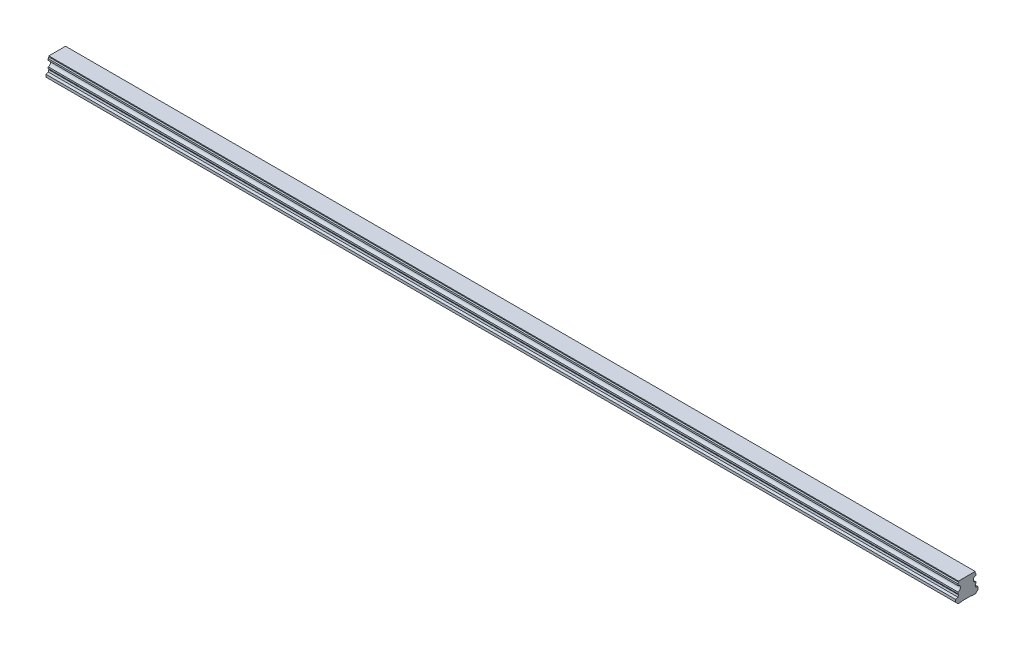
from build123d import *

# Parameters (mm, degrees)
BOSS_EXTRUDE1_DEPTH        = 1020
SKETCH3_R                  = 3
SKETCH3_R_2                = 2.5
CUT_EXTRUDE3_DEPTH         = 12
SKETCH3_2_R                = 2.5
CUT_EXTRUDE4_DEPTH         = 15
CHAMFER1_SIZE              = 0.5
LPATTERN4_COUNT            = 17
LPATTERN4_PITCH            = 60
CHAMFER1_OF_LPATTERN4_SIZE = 0.5


with BuildPart() as part:
    # Sketch1 → Boss-Extrude1 (new body)
    with BuildSketch(Plane(origin=(0, 0, 0), x_dir=(0, 0, -1), z_dir=(1, 0, 0))):
        with BuildLine():
            Line((9.375, 21.8), (-9.375, 21.8))
            Line((-9.375, 21.8), (-9.375, 20.756))
            Line((-9.375, 20.756), (-10, 19.415683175))
            Line((-10, 19.415683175), (-10, 17.685449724))
            ThreePointArc((-10, 17.685449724), (-7.2, 14.6), (-10, 11.514550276))
            Line((-10, 11.514550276), (-10, 9.784316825))
            Line((-10, 9.784316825), (-9.375, 8.444))
            Line((-9.375, 8.444), (-9.922688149, 6.4))
            Line((-9.922688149, 6.4), (-12.5, 5.489338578))
            Line((-12.5, 5.489338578), (-12.5, 2.65))
            Line((-12.5, 2.65), (-9.85, 0))
            Line((-9.85, 0), (-5.5, 0))
            Line((-5.5, 0), (-5, 0.5))
            Line((-5, 0.5), (5, 0.5))
            Line((5, 0.5), (5.5, 0))
            Line((5.5, 0), (9.85, 0))
            Line((9.85, 0), (12.5, 2.65))
            Line((12.5, 2.65), (12.5, 5.489338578))
            Line((12.5, 5.489338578), (9.922688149, 6.4))
            Line((9.922688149, 6.4), (9.375, 8.444))
            Line((9.375, 8.444), (10, 9.784316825))
            Line((10, 9.784316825), (10, 11.514550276))
            ThreePointArc((10, 11.514550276), (7.2, 14.6), (10, 17.685449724))
            Line((10, 17.685449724), (10, 19.415683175))
            Line((10, 19.415683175), (9.375, 20.756))
            Line((9.375, 20.756), (9.375, 21.8))
        make_face()
    extrude(amount=BOSS_EXTRUDE1_DEPTH)

    # Sketch3 → Cut-Extrude3 (cut)
    with BuildSketch(Plane.XZ):
        with Locations(Location((30, 0, 0), (0, 0, 270))):
            Circle(SKETCH3_R)
        with Locations(Location((30, 0, 0), (0, 0, 270))):
            Circle(SKETCH3_R_2, mode=Mode.SUBTRACT)
    cut_extrude3 = extrude(amount=-CUT_EXTRUDE3_DEPTH, mode=Mode.SUBTRACT)

    # Sketch3_2 → Cut-Extrude4 (cut)
    with BuildSketch(Plane.XZ):
        with Locations(Location((30, 0, 0), (0, 0, 270))):
            Circle(SKETCH3_2_R)
    cut_extrude4 = extrude(amount=-CUT_EXTRUDE4_DEPTH, mode=Mode.SUBTRACT)

    # Cut-Extrude5 cone 1 section (on through the dimple's axis) → Cut-Extrude5 (revolve, cut)
    with BuildSketch(Plane(origin=(30, 15, 0), x_dir=(0, 0, -1), z_dir=(1, 0, 0))):
        Polygon((0, 0), (2.5, 0), (0, 1.443375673), align=None)
    cut_extrude5 = revolve(axis=Axis((30, 15, 0), (0, 1, 0)), mode=Mode.SUBTRACT)

    # Chamfer1
    chamfer1_edges = [part.edges().sort_by_distance(p)[0] for p in [
        (30, 0.5, 3),
    ]]
    chamfer(chamfer1_edges, length=CHAMFER1_SIZE)

    # LPattern4: Cut-Extrude3, Cut-Extrude4, Cut-Extrude5 ×17
    with Locations(*[(i * LPATTERN4_PITCH, 0, 0) for i in range(1, LPATTERN4_COUNT)]):
        add(cut_extrude3, mode=Mode.SUBTRACT)
        add(cut_extrude4, mode=Mode.SUBTRACT)
        add(cut_extrude5, mode=Mode.SUBTRACT)

    # Chamfer1 of LPattern4
    chamfer1_of_lpattern4_edges = [part.edges().sort_by_distance(p)[0] for p in [
        (90, 0.5, 3),
        (150, 0.5, 3),
        (210, 0.5, 3),
        (270, 0.5, 3),
        (330, 0.5, 3),
        (390, 0.5, 3),
        (450, 0.5, 3),
        (510, 0.5, 3),
        (570, 0.5, 3),
        (630, 0.5, 3),
        (690, 0.5, 3),
        (750, 0.5, 3),
        (810, 0.5, 3),
        (870, 0.5, 3),
        (930, 0.5, 3),
        (990, 0.5, 3),
    ]]
    chamfer(chamfer1_of_lpattern4_edges, length=CHAMFER1_OF_LPATTERN4_SIZE)


solid = part.part
